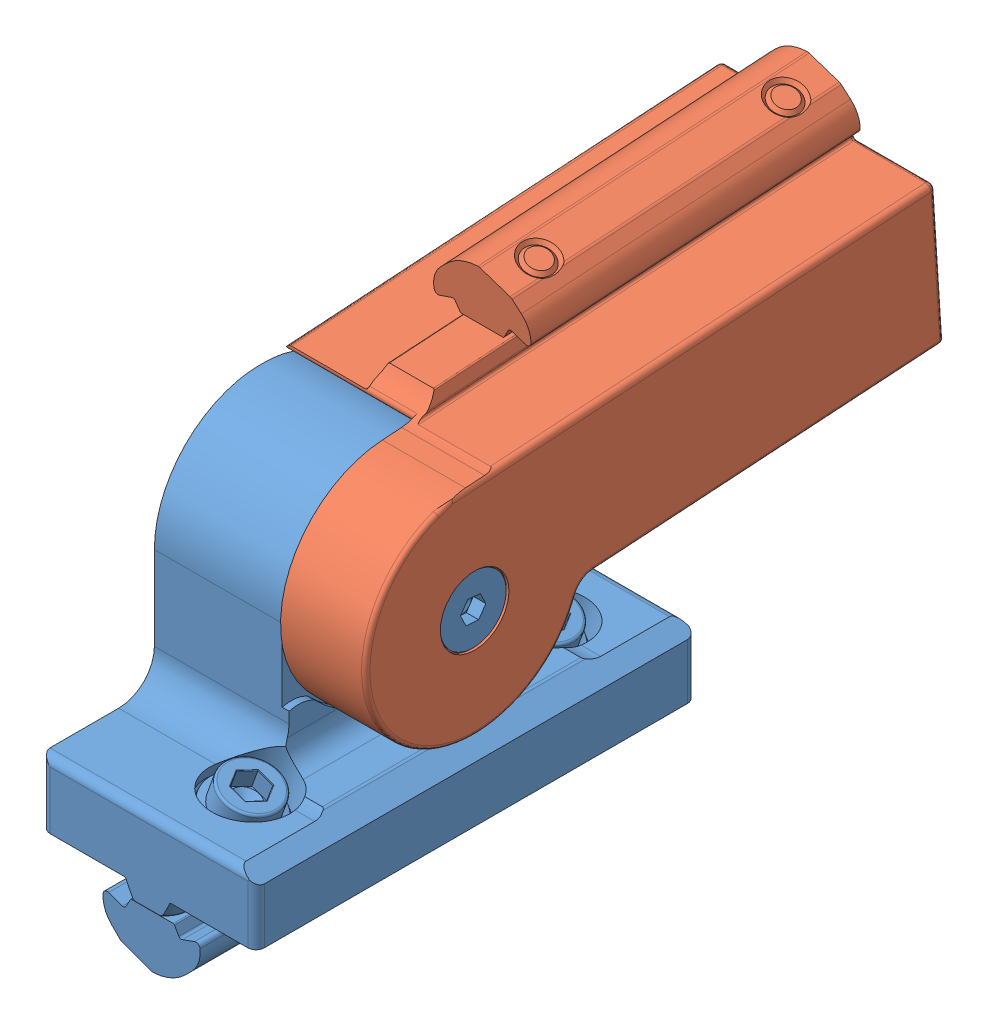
SolidWorks assembly 40mm Pivot Bracket Profile to Offset Profile Mount Kit.SLDASM, configuration Standard (file format 13000). Lengths in mm.
Overall size (39.27 84.77 126.34).
2 component instances, 2 part files, 4 mates.
Components (placement in the parent):
- 40mm Pivot Bracket Profile Mount Bearing Side-1: 40mm Pivot Bracket Profile Mount Bearing Side.SLDPRT [Standard] at (77.8166 59.8355 27.2847) size (39.27 66.24 80)
- 40mm Pivot Bracket Offset Profile Mount Axle Side-2: 40mm Pivot Bracket Offset Profile Mount Axle Side.SLDPRT [Standard] at (81.2587 92.0839 -90.2764) x (0 0.064564 -0.997914) z (-1 0 0) size (105.04 52.4 39)
Mates (geometry in assembly coordinates):
- Concentric1: concentric anti-aligned: cylinder of 40mm Pivot Bracket Profile Mount Bearing Side-1 through (57.9624 59.2282 55.8747) axis (1 0 0) radius 14.975; cylinder of 40mm Pivot Bracket Offset Profile Mount Axle Side-1/Pivot Bracket Extrusion-1 through (50.2564 59.2282 55.8747) axis (-1 0 0) radius 5.9944
- Coincident1: coincident anti-aligned: plane of 40mm Pivot Bracket Profile Mount Bearing Side-1 through (39.2564 39.9782 73.7213) normal (1 0 0); plane of 40mm Pivot Bracket Offset Profile Mount Axle Side-1/Pivot Bracket Extrusion-1 through (39.2564 66.4725 30.8393) normal (-1 0 0)
- Concentric2: concentric anti-aligned: cylinder of 40mm Pivot Bracket Profile Mount Bearing Side-1 through (57.9624 59.2282 55.8747) axis (1 0 0) radius 5.9817; cylinder of 40mm Pivot Bracket Offset Profile Mount Axle Side-2 through (50.2564 59.2282 55.8747) axis (-1 0 0) radius 5.9944
- Coincident3: coincident anti-aligned: plane of 40mm Pivot Bracket Profile Mount Bearing Side-1 through (39.2564 39.9782 73.7213) normal (1 0 0); plane of 40mm Pivot Bracket Offset Profile Mount Axle Side-2 through (39.2564 66.8532 30.9526) normal (-1 0 0)
